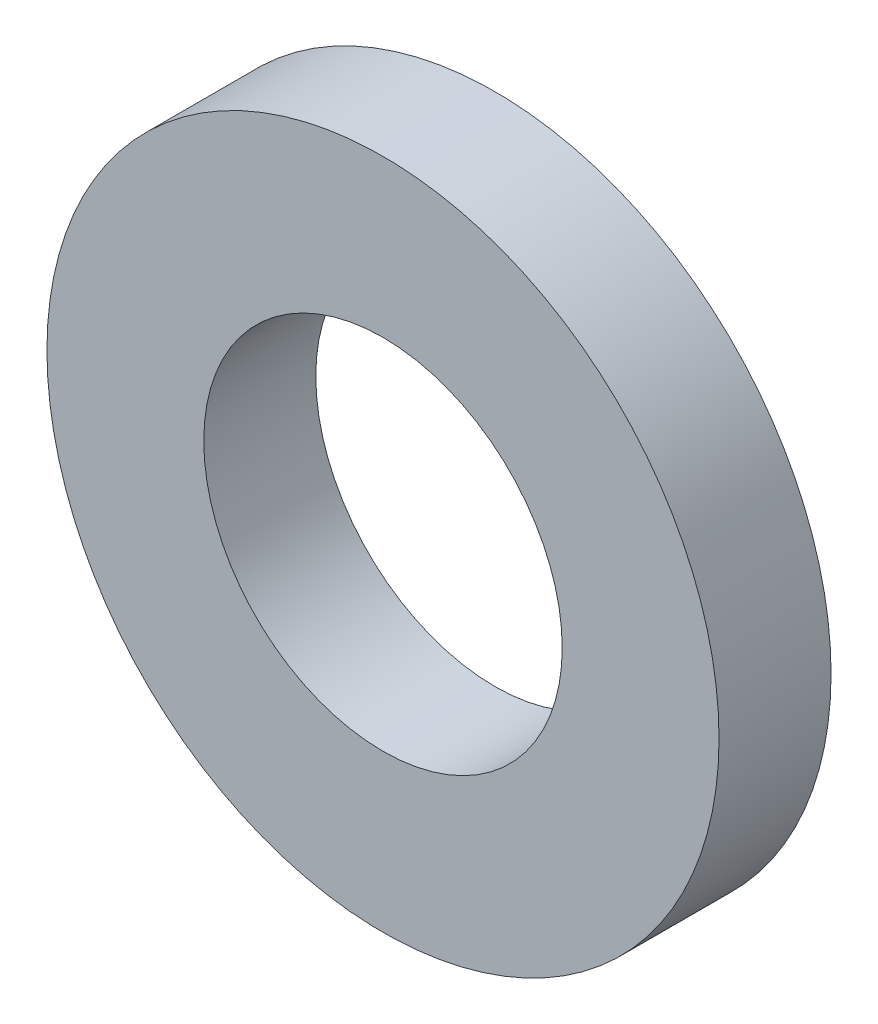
from build123d import *

# Parameters (mm, degrees)
CROQUIS1_R              = 7.5
CROQUIS1_R_2            = 4
SALIENTE_EXTRUIR1_DEPTH = 1.25


with BuildPart() as part:
    # Croquis1 → Saliente-Extruir1 (new, symmetric)
    with BuildSketch(Plane.XY):
        Circle(CROQUIS1_R)
        Circle(CROQUIS1_R_2, mode=Mode.SUBTRACT)
    extrude(amount=SALIENTE_EXTRUIR1_DEPTH, both=True)


solid = part.part
